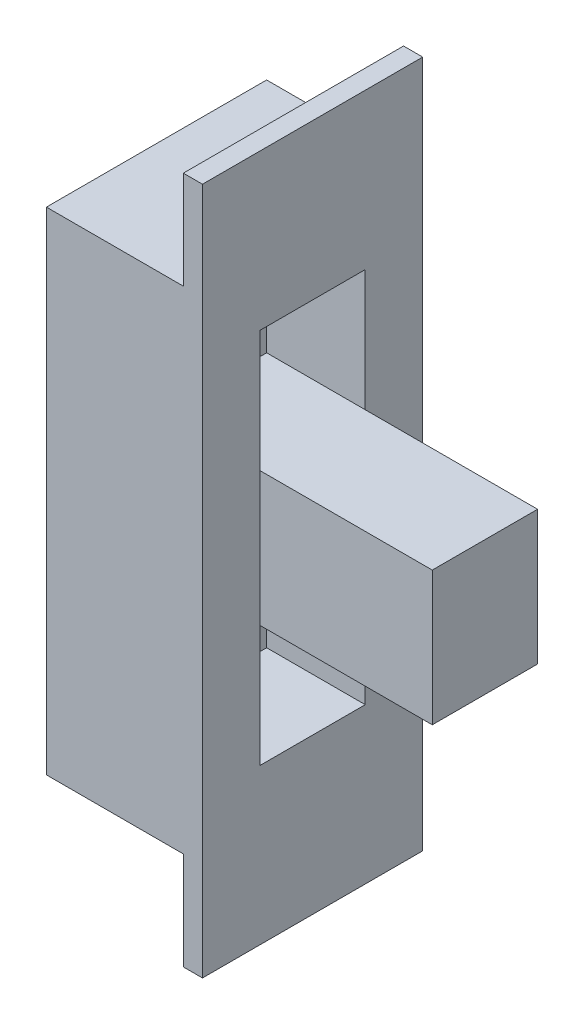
ISO-10303-21;
HEADER;
FILE_DESCRIPTION(('STEP AP214'),'2;1');
FILE_NAME('part.step','',(''),(''),'','','');
FILE_SCHEMA(('AUTOMOTIVE_DESIGN { 1 0 10303 214 1 1 1 1 }'));
ENDSEC;
DATA;
#1=APPLICATION_CONTEXT('core data for automotive mechanical design processes');
#2=APPLICATION_PROTOCOL_DEFINITION('international standard','automotive_design',2000,#1);
#3=PRODUCT_CONTEXT('',#1,'mechanical');
#4=PRODUCT('Part','Part','',(#3));
#5=PRODUCT_RELATED_PRODUCT_CATEGORY('part','',(#4));
#6=PRODUCT_DEFINITION_FORMATION('','',#4);
#7=PRODUCT_DEFINITION_CONTEXT('part definition',#1,'design');
#8=PRODUCT_DEFINITION('design','',#6,#7);
#9=PRODUCT_DEFINITION_SHAPE('','',#8);
#10=(LENGTH_UNIT() NAMED_UNIT(*) SI_UNIT(.MILLI.,.METRE.));
#11=(NAMED_UNIT(*) PLANE_ANGLE_UNIT() SI_UNIT($,.RADIAN.));
#12=(NAMED_UNIT(*) SI_UNIT($,.STERADIAN.) SOLID_ANGLE_UNIT());
#13=UNCERTAINTY_MEASURE_WITH_UNIT(LENGTH_MEASURE(1.E-05),#10,'distance_accuracy_value','');
#14=(GEOMETRIC_REPRESENTATION_CONTEXT(3) GLOBAL_UNCERTAINTY_ASSIGNED_CONTEXT((#13)) GLOBAL_UNIT_ASSIGNED_CONTEXT((#10,
#11,#12)) REPRESENTATION_CONTEXT('',''));
#15=CARTESIAN_POINT('',(0.,0.,0.));
#16=DIRECTION('',(0.,0.,1.));
#17=DIRECTION('',(1.,0.,0.));
#18=AXIS2_PLACEMENT_3D('',#15,#16,#17);
#19=CARTESIAN_POINT('',(-35.8250258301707,28.9408534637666,8.49999999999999));
#20=DIRECTION('',(0.,0.,-1.));
#21=DIRECTION('',(-1.,0.,0.));
#22=AXIS2_PLACEMENT_3D('',#19,#20,#21);
#23=PLANE('',#22);
#24=DIRECTION('',(0.,1.,0.));
#25=VECTOR('',#24,1.);
#26=CARTESIAN_POINT('',(-12.3925708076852,28.9408534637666,8.49999999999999));
#27=LINE('',#26,#25);
#28=CARTESIAN_POINT('',(-12.3925708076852,28.9408534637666,8.49999999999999));
#29=VERTEX_POINT('',#28);
#30=CARTESIAN_POINT('',(-12.3925708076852,35.2793865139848,8.49999999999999));
#31=VERTEX_POINT('',#30);
#32=EDGE_CURVE('E228',#29,#31,#27,.T.);
#33=ORIENTED_EDGE('',*,*,#32,.T.);
#34=DIRECTION('',(-1.,0.,0.));
#35=VECTOR('',#34,1.);
#36=CARTESIAN_POINT('',(10.6596760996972,35.2793865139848,8.50000000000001));
#37=LINE('',#36,#35);
#38=CARTESIAN_POINT('',(-7.24257080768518,35.2793865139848,8.49999999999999));
#39=VERTEX_POINT('',#38);
#40=EDGE_CURVE('E57',#39,#31,#37,.T.);
#41=ORIENTED_EDGE('',*,*,#40,.F.);
#42=DIRECTION('',(0.,1.,0.));
#43=VECTOR('',#42,1.);
#44=CARTESIAN_POINT('',(-7.24257080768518,28.9408534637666,8.49999999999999));
#45=LINE('',#44,#43);
#46=CARTESIAN_POINT('',(-7.24257080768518,28.9408534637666,8.49999999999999));
#47=VERTEX_POINT('',#46);
#48=EDGE_CURVE('E218',#47,#39,#45,.T.);
#49=ORIENTED_EDGE('',*,*,#48,.F.);
#50=DIRECTION('',(1.,0.,0.));
#51=VECTOR('',#50,1.);
#52=CARTESIAN_POINT('',(-35.8250258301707,28.9408534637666,8.49999999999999));
#53=LINE('',#52,#51);
#54=EDGE_CURVE('E223',#29,#47,#53,.T.);
#55=ORIENTED_EDGE('',*,*,#54,.F.);
#56=EDGE_LOOP('',(#33,#41,#49,#55));
#57=FACE_BOUND('',#56,.T.);
#58=ADVANCED_FACE('F32',(#57),#23,.T.);
#59=CARTESIAN_POINT('',(-35.8250258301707,48.6191465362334,3.));
#60=DIRECTION('',(0.,0.,1.));
#61=DIRECTION('',(1.,0.,0.));
#62=AXIS2_PLACEMENT_3D('',#59,#60,#61);
#63=PLANE('',#62);
#64=DIRECTION('',(0.,-1.,0.));
#65=VECTOR('',#64,1.);
#66=CARTESIAN_POINT('',(-7.24257080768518,48.6191465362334,3.));
#67=LINE('',#66,#65);
#68=CARTESIAN_POINT('',(-7.24257080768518,35.2793865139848,3.));
#69=VERTEX_POINT('',#68);
#70=CARTESIAN_POINT('',(-7.24257080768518,28.9408534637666,3.));
#71=VERTEX_POINT('',#70);
#72=EDGE_CURVE('E212',#69,#71,#67,.T.);
#73=ORIENTED_EDGE('',*,*,#72,.F.);
#74=DIRECTION('',(-1.,0.,0.));
#75=VECTOR('',#74,1.);
#76=CARTESIAN_POINT('',(10.6596760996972,35.2793865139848,3.));
#77=LINE('',#76,#75);
#78=CARTESIAN_POINT('',(-12.3925708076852,35.2793865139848,3.));
#79=VERTEX_POINT('',#78);
#80=EDGE_CURVE('E181',#69,#79,#77,.T.);
#81=ORIENTED_EDGE('',*,*,#80,.T.);
#82=DIRECTION('',(0.,-1.,0.));
#83=VECTOR('',#82,1.);
#84=CARTESIAN_POINT('',(-12.3925708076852,48.6191465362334,3.));
#85=LINE('',#84,#83);
#86=CARTESIAN_POINT('',(-12.3925708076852,28.9408534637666,3.));
#87=VERTEX_POINT('',#86);
#88=EDGE_CURVE('E211',#79,#87,#85,.T.);
#89=ORIENTED_EDGE('',*,*,#88,.T.);
#90=DIRECTION('',(1.,0.,0.));
#91=VECTOR('',#90,1.);
#92=CARTESIAN_POINT('',(-35.8250258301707,28.9408534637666,3.));
#93=LINE('',#92,#91);
#94=EDGE_CURVE('E207',#87,#71,#93,.T.);
#95=ORIENTED_EDGE('',*,*,#94,.T.);
#96=EDGE_LOOP('',(#73,#81,#89,#95));
#97=FACE_BOUND('',#96,.T.);
#98=ADVANCED_FACE('F359',(#97),#63,.T.);
#99=CARTESIAN_POINT('',(-12.3925708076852,25.9408534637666,0.));
#100=DIRECTION('',(-1.,0.,0.));
#101=DIRECTION('',(0.,0.,1.));
#102=AXIS2_PLACEMENT_3D('',#99,#100,#101);
#103=PLANE('',#102);
#104=DIRECTION('',(0.,0.,-1.));
#105=VECTOR('',#104,1.);
#106=CARTESIAN_POINT('',(-12.3925708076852,35.2793865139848,8.50000000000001));
#107=LINE('',#106,#105);
#108=EDGE_CURVE('E193',#31,#79,#107,.T.);
#109=ORIENTED_EDGE('',*,*,#108,.F.);
#110=ORIENTED_EDGE('',*,*,#32,.F.);
#111=DIRECTION('',(0.,0.,1.));
#112=VECTOR('',#111,1.);
#113=CARTESIAN_POINT('',(-12.3925708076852,28.9408534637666,3.));
#114=LINE('',#113,#112);
#115=EDGE_CURVE('E231',#87,#29,#114,.T.);
#116=ORIENTED_EDGE('',*,*,#115,.F.);
#117=ORIENTED_EDGE('',*,*,#88,.F.);
#118=EDGE_LOOP('',(#109,#110,#116,#117));
#119=FACE_BOUND('',#118,.T.);
#120=ADVANCED_FACE('F365',(#119),#103,.F.);
#121=CARTESIAN_POINT('',(-7.24257080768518,56.73,11.5));
#122=DIRECTION('',(1.,0.,0.));
#123=DIRECTION('',(0.,0.,-1.));
#124=AXIS2_PLACEMENT_3D('',#121,#122,#123);
#125=PLANE('',#124);
#126=DIRECTION('',(0.,-1.,0.));
#127=VECTOR('',#126,1.);
#128=CARTESIAN_POINT('',(-7.24257080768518,56.73,11.5));
#129=LINE('',#128,#127);
#130=CARTESIAN_POINT('',(-7.24257080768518,56.73,11.5));
#131=VERTEX_POINT('',#130);
#132=CARTESIAN_POINT('',(-7.24257080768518,20.83,11.5));
#133=VERTEX_POINT('',#132);
#134=EDGE_CURVE('E309',#131,#133,#129,.T.);
#135=ORIENTED_EDGE('',*,*,#134,.T.);
#136=DIRECTION('',(0.,0.,-1.));
#137=VECTOR('',#136,1.);
#138=CARTESIAN_POINT('',(-7.24257080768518,20.83,11.5));
#139=LINE('',#138,#137);
#140=CARTESIAN_POINT('',(-7.24257080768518,20.83,0.));
#141=VERTEX_POINT('',#140);
#142=EDGE_CURVE('E306',#133,#141,#139,.T.);
#143=ORIENTED_EDGE('',*,*,#142,.T.);
#144=DIRECTION('',(0.,-1.,0.));
#145=VECTOR('',#144,1.);
#146=CARTESIAN_POINT('',(-7.24257080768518,56.73,0.));
#147=LINE('',#146,#145);
#148=CARTESIAN_POINT('',(-7.24257080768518,56.73,0.));
#149=VERTEX_POINT('',#148);
#150=EDGE_CURVE('E290',#149,#141,#147,.T.);
#151=ORIENTED_EDGE('',*,*,#150,.F.);
#152=DIRECTION('',(0.,0.,-1.));
#153=VECTOR('',#152,1.);
#154=CARTESIAN_POINT('',(-7.24257080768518,56.73,11.5));
#155=LINE('',#154,#153);
#156=EDGE_CURVE('E308',#131,#149,#155,.T.);
#157=ORIENTED_EDGE('',*,*,#156,.F.);
#158=EDGE_LOOP('',(#135,#143,#151,#157));
#159=FACE_BOUND('',#158,.T.);
#160=CARTESIAN_POINT('',(-7.24257080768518,48.6191465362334,3.));
#161=VERTEX_POINT('',#160);
#162=CARTESIAN_POINT('',(-7.24257080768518,42.2793865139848,3.));
#163=VERTEX_POINT('',#162);
#164=EDGE_CURVE('E208',#161,#163,#67,.T.);
#165=ORIENTED_EDGE('',*,*,#164,.T.);
#166=DIRECTION('',(0.,-1.,0.));
#167=VECTOR('',#166,1.);
#168=CARTESIAN_POINT('',(-7.24257080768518,56.73,3.));
#169=LINE('',#168,#167);
#170=EDGE_CURVE('E178',#163,#69,#169,.T.);
#171=ORIENTED_EDGE('',*,*,#170,.T.);
#172=ORIENTED_EDGE('',*,*,#72,.T.);
#173=DIRECTION('',(0.,0.,1.));
#174=VECTOR('',#173,1.);
#175=CARTESIAN_POINT('',(-7.24257080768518,28.9408534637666,3.));
#176=LINE('',#175,#174);
#177=EDGE_CURVE('E220',#71,#47,#176,.T.);
#178=ORIENTED_EDGE('',*,*,#177,.T.);
#179=ORIENTED_EDGE('',*,*,#48,.T.);
#180=DIRECTION('',(0.,1.,0.));
#181=VECTOR('',#180,1.);
#182=CARTESIAN_POINT('',(-7.24257080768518,56.73,8.50000000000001));
#183=LINE('',#182,#181);
#184=CARTESIAN_POINT('',(-7.24257080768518,42.2793865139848,8.49999999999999));
#185=VERTEX_POINT('',#184);
#186=EDGE_CURVE('E203',#39,#185,#183,.T.);
#187=ORIENTED_EDGE('',*,*,#186,.T.);
#188=CARTESIAN_POINT('',(-7.24257080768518,48.6191465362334,8.49999999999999));
#189=VERTEX_POINT('',#188);
#190=EDGE_CURVE('E49',#185,#189,#45,.T.);
#191=ORIENTED_EDGE('',*,*,#190,.T.);
#192=DIRECTION('',(0.,0.,-1.));
#193=VECTOR('',#192,1.);
#194=CARTESIAN_POINT('',(-7.24257080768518,48.6191465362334,8.49999999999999));
#195=LINE('',#194,#193);
#196=EDGE_CURVE('E213',#189,#161,#195,.T.);
#197=ORIENTED_EDGE('',*,*,#196,.T.);
#198=EDGE_LOOP('',(#165,#171,#172,#178,#179,#187,#191,#197));
#199=FACE_BOUND('',#198,.T.);
#200=ADVANCED_FACE('F321',(#159,#199),#125,.T.);
#201=CARTESIAN_POINT('',(-8.24257080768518,20.83,11.5));
#202=DIRECTION('',(-1.,0.,0.));
#203=DIRECTION('',(0.,0.,1.));
#204=AXIS2_PLACEMENT_3D('',#201,#202,#203);
#205=PLANE('',#204);
#206=DIRECTION('',(0.,1.,0.));
#207=VECTOR('',#206,1.);
#208=CARTESIAN_POINT('',(-8.24257080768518,20.83,0.));
#209=LINE('',#208,#207);
#210=CARTESIAN_POINT('',(-8.24257080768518,51.6191465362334,0.));
#211=VERTEX_POINT('',#210);
#212=CARTESIAN_POINT('',(-8.24257080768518,56.73,0.));
#213=VERTEX_POINT('',#212);
#214=EDGE_CURVE('E277',#211,#213,#209,.T.);
#215=ORIENTED_EDGE('',*,*,#214,.F.);
#216=DIRECTION('',(0.,0.,1.));
#217=VECTOR('',#216,1.);
#218=CARTESIAN_POINT('',(-8.24257080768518,51.6191465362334,0.));
#219=LINE('',#218,#217);
#220=CARTESIAN_POINT('',(-8.24257080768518,51.6191465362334,11.5));
#221=VERTEX_POINT('',#220);
#222=EDGE_CURVE('E250',#211,#221,#219,.T.);
#223=ORIENTED_EDGE('',*,*,#222,.T.);
#224=DIRECTION('',(0.,1.,0.));
#225=VECTOR('',#224,1.);
#226=CARTESIAN_POINT('',(-8.24257080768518,20.83,11.5));
#227=LINE('',#226,#225);
#228=CARTESIAN_POINT('',(-8.24257080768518,56.73,11.5));
#229=VERTEX_POINT('',#228);
#230=EDGE_CURVE('E296',#221,#229,#227,.T.);
#231=ORIENTED_EDGE('',*,*,#230,.T.);
#232=DIRECTION('',(0.,0.,-1.));
#233=VECTOR('',#232,1.);
#234=CARTESIAN_POINT('',(-8.24257080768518,56.73,11.5));
#235=LINE('',#234,#233);
#236=EDGE_CURVE('E11',#229,#213,#235,.T.);
#237=ORIENTED_EDGE('',*,*,#236,.T.);
#238=EDGE_LOOP('',(#215,#223,#231,#237));
#239=FACE_BOUND('',#238,.T.);
#240=ADVANCED_FACE('F335',(#239),#205,.T.);
#241=CARTESIAN_POINT('',(-7.24257080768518,56.73,11.5));
#242=DIRECTION('',(0.,-1.,0.));
#243=DIRECTION('',(0.,0.,-1.));
#244=AXIS2_PLACEMENT_3D('',#241,#242,#243);
#245=PLANE('',#244);
#246=ORIENTED_EDGE('',*,*,#236,.F.);
#247=DIRECTION('',(-1.,0.,0.));
#248=VECTOR('',#247,1.);
#249=CARTESIAN_POINT('',(-7.24257080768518,56.73,11.5));
#250=LINE('',#249,#248);
#251=EDGE_CURVE('E293',#131,#229,#250,.T.);
#252=ORIENTED_EDGE('',*,*,#251,.F.);
#253=ORIENTED_EDGE('',*,*,#156,.T.);
#254=DIRECTION('',(-1.,0.,0.));
#255=VECTOR('',#254,1.);
#256=CARTESIAN_POINT('',(-7.24257080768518,56.73,0.));
#257=LINE('',#256,#255);
#258=EDGE_CURVE('E256',#149,#213,#257,.T.);
#259=ORIENTED_EDGE('',*,*,#258,.T.);
#260=EDGE_LOOP('',(#246,#252,#253,#259));
#261=FACE_BOUND('',#260,.T.);
#262=ADVANCED_FACE('F331',(#261),#245,.F.);
#263=DIRECTION('',(0.,0.,1.));
#264=VECTOR('',#263,1.);
#265=CARTESIAN_POINT('',(-8.24257080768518,25.9408534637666,0.));
#266=LINE('',#265,#264);
#267=CARTESIAN_POINT('',(-8.24257080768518,25.9408534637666,0.));
#268=VERTEX_POINT('',#267);
#269=CARTESIAN_POINT('',(-8.24257080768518,25.9408534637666,11.5));
#270=VERTEX_POINT('',#269);
#271=EDGE_CURVE('E227',#268,#270,#266,.T.);
#272=ORIENTED_EDGE('',*,*,#271,.F.);
#273=CARTESIAN_POINT('',(-8.24257080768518,20.83,0.));
#274=VERTEX_POINT('',#273);
#275=EDGE_CURVE('E280',#274,#268,#209,.T.);
#276=ORIENTED_EDGE('',*,*,#275,.F.);
#277=DIRECTION('',(0.,0.,-1.));
#278=VECTOR('',#277,1.);
#279=CARTESIAN_POINT('',(-8.24257080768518,20.83,11.5));
#280=LINE('',#279,#278);
#281=CARTESIAN_POINT('',(-8.24257080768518,20.83,11.5));
#282=VERTEX_POINT('',#281);
#283=EDGE_CURVE('E41',#282,#274,#280,.T.);
#284=ORIENTED_EDGE('',*,*,#283,.F.);
#285=EDGE_CURVE('E303',#282,#270,#227,.T.);
#286=ORIENTED_EDGE('',*,*,#285,.T.);
#287=EDGE_LOOP('',(#272,#276,#284,#286));
#288=FACE_BOUND('',#287,.T.);
#289=ADVANCED_FACE('F34',(#288),#205,.T.);
#290=CARTESIAN_POINT('',(-8.24257080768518,20.83,11.5));
#291=DIRECTION('',(0.,1.,0.));
#292=DIRECTION('',(0.,0.,1.));
#293=AXIS2_PLACEMENT_3D('',#290,#291,#292);
#294=PLANE('',#293);
#295=ORIENTED_EDGE('',*,*,#142,.F.);
#296=DIRECTION('',(1.,0.,0.));
#297=VECTOR('',#296,1.);
#298=CARTESIAN_POINT('',(-8.24257080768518,20.83,11.5));
#299=LINE('',#298,#297);
#300=EDGE_CURVE('E299',#282,#133,#299,.T.);
#301=ORIENTED_EDGE('',*,*,#300,.F.);
#302=ORIENTED_EDGE('',*,*,#283,.T.);
#303=DIRECTION('',(1.,0.,0.));
#304=VECTOR('',#303,1.);
#305=CARTESIAN_POINT('',(-8.24257080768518,20.83,0.));
#306=LINE('',#305,#304);
#307=EDGE_CURVE('E286',#274,#141,#306,.T.);
#308=ORIENTED_EDGE('',*,*,#307,.T.);
#309=EDGE_LOOP('',(#295,#301,#302,#308));
#310=FACE_BOUND('',#309,.T.);
#311=ADVANCED_FACE('F317',(#310),#294,.F.);
#312=CARTESIAN_POINT('',(-8.24257080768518,56.73,11.5));
#313=DIRECTION('',(0.,0.,-1.));
#314=DIRECTION('',(-1.,0.,0.));
#315=AXIS2_PLACEMENT_3D('',#312,#313,#314);
#316=PLANE('',#315);
#317=ORIENTED_EDGE('',*,*,#251,.T.);
#318=ORIENTED_EDGE('',*,*,#230,.F.);
#319=DIRECTION('',(1.,0.,0.));
#320=VECTOR('',#319,1.);
#321=CARTESIAN_POINT('',(-15.3925708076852,51.6191465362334,11.5));
#322=LINE('',#321,#320);
#323=CARTESIAN_POINT('',(-15.3925708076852,51.6191465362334,11.5));
#324=VERTEX_POINT('',#323);
#325=EDGE_CURVE('E263',#324,#221,#322,.T.);
#326=ORIENTED_EDGE('',*,*,#325,.F.);
#327=DIRECTION('',(0.,1.,0.));
#328=VECTOR('',#327,1.);
#329=CARTESIAN_POINT('',(-15.3925708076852,25.9408534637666,11.5));
#330=LINE('',#329,#328);
#331=CARTESIAN_POINT('',(-15.3925708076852,25.9408534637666,11.5));
#332=VERTEX_POINT('',#331);
#333=EDGE_CURVE('E345',#332,#324,#330,.T.);
#334=ORIENTED_EDGE('',*,*,#333,.F.);
#335=DIRECTION('',(1.,0.,0.));
#336=VECTOR('',#335,1.);
#337=CARTESIAN_POINT('',(-15.3925708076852,25.9408534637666,11.5));
#338=LINE('',#337,#336);
#339=EDGE_CURVE('E257',#332,#270,#338,.T.);
#340=ORIENTED_EDGE('',*,*,#339,.T.);
#341=ORIENTED_EDGE('',*,*,#285,.F.);
#342=ORIENTED_EDGE('',*,*,#300,.T.);
#343=ORIENTED_EDGE('',*,*,#134,.F.);
#344=EDGE_LOOP('',(#317,#318,#326,#334,#340,#341,#342,#343));
#345=FACE_BOUND('',#344,.T.);
#346=ADVANCED_FACE('F315',(#345),#316,.F.);
#347=CARTESIAN_POINT('',(-8.24257080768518,56.73,0.));
#348=DIRECTION('',(0.,0.,-1.));
#349=DIRECTION('',(-1.,0.,0.));
#350=AXIS2_PLACEMENT_3D('',#347,#348,#349);
#351=PLANE('',#350);
#352=ORIENTED_EDGE('',*,*,#258,.F.);
#353=ORIENTED_EDGE('',*,*,#150,.T.);
#354=ORIENTED_EDGE('',*,*,#307,.F.);
#355=ORIENTED_EDGE('',*,*,#275,.T.);
#356=DIRECTION('',(1.,0.,0.));
#357=VECTOR('',#356,1.);
#358=CARTESIAN_POINT('',(-15.3925708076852,25.9408534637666,0.));
#359=LINE('',#358,#357);
#360=CARTESIAN_POINT('',(-15.3925708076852,25.9408534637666,0.));
#361=VERTEX_POINT('',#360);
#362=EDGE_CURVE('E253',#361,#268,#359,.T.);
#363=ORIENTED_EDGE('',*,*,#362,.F.);
#364=DIRECTION('',(0.,-1.,0.));
#365=VECTOR('',#364,1.);
#366=CARTESIAN_POINT('',(-15.3925708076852,51.6191465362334,0.));
#367=LINE('',#366,#365);
#368=CARTESIAN_POINT('',(-15.3925708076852,51.6191465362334,0.));
#369=VERTEX_POINT('',#368);
#370=EDGE_CURVE('E267',#369,#361,#367,.T.);
#371=ORIENTED_EDGE('',*,*,#370,.F.);
#372=DIRECTION('',(1.,0.,0.));
#373=VECTOR('',#372,1.);
#374=CARTESIAN_POINT('',(-15.3925708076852,51.6191465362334,0.));
#375=LINE('',#374,#373);
#376=EDGE_CURVE('E260',#369,#211,#375,.T.);
#377=ORIENTED_EDGE('',*,*,#376,.T.);
#378=ORIENTED_EDGE('',*,*,#214,.T.);
#379=EDGE_LOOP('',(#352,#353,#354,#355,#363,#371,#377,#378));
#380=FACE_BOUND('',#379,.T.);
#381=ADVANCED_FACE('F326',(#380),#351,.T.);
#382=CARTESIAN_POINT('',(-15.3925708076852,25.9408534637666,0.));
#383=DIRECTION('',(0.,1.,0.));
#384=DIRECTION('',(0.,0.,1.));
#385=AXIS2_PLACEMENT_3D('',#382,#383,#384);
#386=PLANE('',#385);
#387=ORIENTED_EDGE('',*,*,#339,.F.);
#388=DIRECTION('',(0.,0.,1.));
#389=VECTOR('',#388,1.);
#390=CARTESIAN_POINT('',(-15.3925708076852,25.9408534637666,0.));
#391=LINE('',#390,#389);
#392=EDGE_CURVE('E343',#361,#332,#391,.T.);
#393=ORIENTED_EDGE('',*,*,#392,.F.);
#394=ORIENTED_EDGE('',*,*,#362,.T.);
#395=ORIENTED_EDGE('',*,*,#271,.T.);
#396=EDGE_LOOP('',(#387,#393,#394,#395));
#397=FACE_BOUND('',#396,.T.);
#398=ADVANCED_FACE('F349',(#397),#386,.F.);
#399=CARTESIAN_POINT('',(-15.3925708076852,51.6191465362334,0.));
#400=DIRECTION('',(0.,1.,0.));
#401=DIRECTION('',(0.,0.,1.));
#402=AXIS2_PLACEMENT_3D('',#399,#400,#401);
#403=PLANE('',#402);
#404=DIRECTION('',(0.,0.,1.));
#405=VECTOR('',#404,1.);
#406=CARTESIAN_POINT('',(-15.3925708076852,51.6191465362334,0.));
#407=LINE('',#406,#405);
#408=EDGE_CURVE('E264',#369,#324,#407,.T.);
#409=ORIENTED_EDGE('',*,*,#408,.T.);
#410=ORIENTED_EDGE('',*,*,#325,.T.);
#411=ORIENTED_EDGE('',*,*,#222,.F.);
#412=ORIENTED_EDGE('',*,*,#376,.F.);
#413=EDGE_LOOP('',(#409,#410,#411,#412));
#414=FACE_BOUND('',#413,.T.);
#415=ADVANCED_FACE('F336',(#414),#403,.T.);
#416=CARTESIAN_POINT('',(-15.3925708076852,25.9408534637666,0.));
#417=DIRECTION('',(-1.,0.,0.));
#418=DIRECTION('',(0.,0.,1.));
#419=AXIS2_PLACEMENT_3D('',#416,#417,#418);
#420=PLANE('',#419);
#421=ORIENTED_EDGE('',*,*,#370,.T.);
#422=ORIENTED_EDGE('',*,*,#392,.T.);
#423=ORIENTED_EDGE('',*,*,#333,.T.);
#424=ORIENTED_EDGE('',*,*,#408,.F.);
#425=EDGE_LOOP('',(#421,#422,#423,#424));
#426=FACE_BOUND('',#425,.T.);
#427=ADVANCED_FACE('F344',(#426),#420,.T.);
#428=CARTESIAN_POINT('',(-35.8250258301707,28.9408534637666,3.));
#429=DIRECTION('',(0.,1.,0.));
#430=DIRECTION('',(0.,0.,1.));
#431=AXIS2_PLACEMENT_3D('',#428,#429,#430);
#432=PLANE('',#431);
#433=ORIENTED_EDGE('',*,*,#115,.T.);
#434=ORIENTED_EDGE('',*,*,#54,.T.);
#435=ORIENTED_EDGE('',*,*,#177,.F.);
#436=ORIENTED_EDGE('',*,*,#94,.F.);
#437=EDGE_LOOP('',(#433,#434,#435,#436));
#438=FACE_BOUND('',#437,.T.);
#439=ADVANCED_FACE('F373',(#438),#432,.T.);
#440=DIRECTION('',(-1.,0.,0.));
#441=VECTOR('',#440,1.);
#442=CARTESIAN_POINT('',(10.6596760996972,42.2793865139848,8.50000000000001));
#443=LINE('',#442,#441);
#444=CARTESIAN_POINT('',(-12.3925708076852,42.2793865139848,8.49999999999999));
#445=VERTEX_POINT('',#444);
#446=EDGE_CURVE('E204',#185,#445,#443,.T.);
#447=ORIENTED_EDGE('',*,*,#446,.T.);
#448=CARTESIAN_POINT('',(-12.3925708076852,48.6191465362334,8.49999999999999));
#449=VERTEX_POINT('',#448);
#450=EDGE_CURVE('E230',#445,#449,#27,.T.);
#451=ORIENTED_EDGE('',*,*,#450,.T.);
#452=DIRECTION('',(1.,0.,0.));
#453=VECTOR('',#452,1.);
#454=CARTESIAN_POINT('',(-35.8250258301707,48.6191465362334,8.49999999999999));
#455=LINE('',#454,#453);
#456=EDGE_CURVE('E217',#449,#189,#455,.T.);
#457=ORIENTED_EDGE('',*,*,#456,.T.);
#458=ORIENTED_EDGE('',*,*,#190,.F.);
#459=EDGE_LOOP('',(#447,#451,#457,#458));
#460=FACE_BOUND('',#459,.T.);
#461=ADVANCED_FACE('F361',(#460),#23,.T.);
#462=CARTESIAN_POINT('',(-35.8250258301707,48.6191465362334,8.49999999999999));
#463=DIRECTION('',(0.,-1.,0.));
#464=DIRECTION('',(0.,0.,-1.));
#465=AXIS2_PLACEMENT_3D('',#462,#463,#464);
#466=PLANE('',#465);
#467=DIRECTION('',(0.,0.,-1.));
#468=VECTOR('',#467,1.);
#469=CARTESIAN_POINT('',(-12.3925708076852,48.6191465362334,8.49999999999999));
#470=LINE('',#469,#468);
#471=CARTESIAN_POINT('',(-12.3925708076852,48.6191465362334,3.));
#472=VERTEX_POINT('',#471);
#473=EDGE_CURVE('E224',#449,#472,#470,.T.);
#474=ORIENTED_EDGE('',*,*,#473,.T.);
#475=DIRECTION('',(1.,0.,0.));
#476=VECTOR('',#475,1.);
#477=CARTESIAN_POINT('',(-35.8250258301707,48.6191465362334,3.));
#478=LINE('',#477,#476);
#479=EDGE_CURVE('E216',#472,#161,#478,.T.);
#480=ORIENTED_EDGE('',*,*,#479,.T.);
#481=ORIENTED_EDGE('',*,*,#196,.F.);
#482=ORIENTED_EDGE('',*,*,#456,.F.);
#483=EDGE_LOOP('',(#474,#480,#481,#482));
#484=FACE_BOUND('',#483,.T.);
#485=ADVANCED_FACE('F372',(#484),#466,.T.);
#486=DIRECTION('',(-1.,0.,0.));
#487=VECTOR('',#486,1.);
#488=CARTESIAN_POINT('',(10.6596760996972,42.2793865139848,3.));
#489=LINE('',#488,#487);
#490=CARTESIAN_POINT('',(-12.3925708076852,42.2793865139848,3.));
#491=VERTEX_POINT('',#490);
#492=EDGE_CURVE('E182',#163,#491,#489,.T.);
#493=ORIENTED_EDGE('',*,*,#492,.F.);
#494=ORIENTED_EDGE('',*,*,#164,.F.);
#495=ORIENTED_EDGE('',*,*,#479,.F.);
#496=EDGE_CURVE('E234',#472,#491,#85,.T.);
#497=ORIENTED_EDGE('',*,*,#496,.T.);
#498=EDGE_LOOP('',(#493,#494,#495,#497));
#499=FACE_BOUND('',#498,.T.);
#500=ADVANCED_FACE('F368',(#499),#63,.T.);
#501=ORIENTED_EDGE('',*,*,#450,.F.);
#502=DIRECTION('',(0.,0.,-1.));
#503=VECTOR('',#502,1.);
#504=CARTESIAN_POINT('',(-12.3925708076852,42.2793865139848,8.50000000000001));
#505=LINE('',#504,#503);
#506=EDGE_CURVE('E171',#445,#491,#505,.T.);
#507=ORIENTED_EDGE('',*,*,#506,.T.);
#508=ORIENTED_EDGE('',*,*,#496,.F.);
#509=ORIENTED_EDGE('',*,*,#473,.F.);
#510=EDGE_LOOP('',(#501,#507,#508,#509));
#511=FACE_BOUND('',#510,.T.);
#512=ADVANCED_FACE('F384',(#511),#103,.F.);
#513=CARTESIAN_POINT('',(1.75742919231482,56.73,11.5));
#514=DIRECTION('',(1.,0.,0.));
#515=DIRECTION('',(0.,0.,-1.));
#516=AXIS2_PLACEMENT_3D('',#513,#514,#515);
#517=PLANE('',#516);
#518=DIRECTION('',(0.,0.,-1.));
#519=VECTOR('',#518,1.);
#520=CARTESIAN_POINT('',(1.75742919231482,42.2793865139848,8.50000000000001));
#521=LINE('',#520,#519);
#522=CARTESIAN_POINT('',(1.75742919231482,42.2793865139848,8.50000000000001));
#523=VERTEX_POINT('',#522);
#524=CARTESIAN_POINT('',(1.75742919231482,42.2793865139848,3.));
#525=VERTEX_POINT('',#524);
#526=EDGE_CURVE('E164',#523,#525,#521,.T.);
#527=ORIENTED_EDGE('',*,*,#526,.F.);
#528=DIRECTION('',(0.,-1.,0.));
#529=VECTOR('',#528,1.);
#530=CARTESIAN_POINT('',(1.75742919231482,42.2793865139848,8.50000000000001));
#531=LINE('',#530,#529);
#532=CARTESIAN_POINT('',(1.75742919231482,35.2793865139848,8.50000000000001));
#533=VERTEX_POINT('',#532);
#534=EDGE_CURVE('E194',#523,#533,#531,.T.);
#535=ORIENTED_EDGE('',*,*,#534,.T.);
#536=DIRECTION('',(0.,0.,-1.));
#537=VECTOR('',#536,1.);
#538=CARTESIAN_POINT('',(1.75742919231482,35.2793865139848,8.50000000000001));
#539=LINE('',#538,#537);
#540=CARTESIAN_POINT('',(1.75742919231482,35.2793865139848,3.));
#541=VERTEX_POINT('',#540);
#542=EDGE_CURVE('E167',#533,#541,#539,.T.);
#543=ORIENTED_EDGE('',*,*,#542,.T.);
#544=DIRECTION('',(0.,1.,0.));
#545=VECTOR('',#544,1.);
#546=CARTESIAN_POINT('',(1.75742919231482,35.2793865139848,3.));
#547=LINE('',#546,#545);
#548=EDGE_CURVE('E160',#541,#525,#547,.T.);
#549=ORIENTED_EDGE('',*,*,#548,.T.);
#550=EDGE_LOOP('',(#527,#535,#543,#549));
#551=FACE_BOUND('',#550,.T.);
#552=ADVANCED_FACE('F162',(#551),#517,.T.);
#553=CARTESIAN_POINT('',(10.6596760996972,42.2793865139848,8.50000000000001));
#554=DIRECTION('',(0.,1.,0.));
#555=DIRECTION('',(0.,0.,1.));
#556=AXIS2_PLACEMENT_3D('',#553,#554,#555);
#557=PLANE('',#556);
#558=EDGE_CURVE('E188',#523,#185,#443,.T.);
#559=ORIENTED_EDGE('',*,*,#558,.F.);
#560=ORIENTED_EDGE('',*,*,#526,.T.);
#561=EDGE_CURVE('E175',#525,#163,#489,.T.);
#562=ORIENTED_EDGE('',*,*,#561,.T.);
#563=ORIENTED_EDGE('',*,*,#492,.T.);
#564=ORIENTED_EDGE('',*,*,#506,.F.);
#565=ORIENTED_EDGE('',*,*,#446,.F.);
#566=EDGE_LOOP('',(#559,#560,#562,#563,#564,#565));
#567=FACE_BOUND('',#566,.T.);
#568=ADVANCED_FACE('F185',(#567),#557,.T.);
#569=CARTESIAN_POINT('',(10.6596760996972,35.2793865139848,3.));
#570=DIRECTION('',(0.,0.,1.));
#571=DIRECTION('',(1.,0.,0.));
#572=AXIS2_PLACEMENT_3D('',#569,#570,#571);
#573=PLANE('',#572);
#574=ORIENTED_EDGE('',*,*,#170,.F.);
#575=ORIENTED_EDGE('',*,*,#561,.F.);
#576=ORIENTED_EDGE('',*,*,#548,.F.);
#577=EDGE_CURVE('E200',#541,#69,#77,.T.);
#578=ORIENTED_EDGE('',*,*,#577,.T.);
#579=EDGE_LOOP('',(#574,#575,#576,#578));
#580=FACE_BOUND('',#579,.T.);
#581=ADVANCED_FACE('F176',(#580),#573,.F.);
#582=CARTESIAN_POINT('',(10.6596760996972,35.2793865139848,8.50000000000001));
#583=DIRECTION('',(0.,1.,0.));
#584=DIRECTION('',(0.,0.,1.));
#585=AXIS2_PLACEMENT_3D('',#582,#583,#584);
#586=PLANE('',#585);
#587=ORIENTED_EDGE('',*,*,#542,.F.);
#588=EDGE_CURVE('E197',#533,#39,#37,.T.);
#589=ORIENTED_EDGE('',*,*,#588,.T.);
#590=ORIENTED_EDGE('',*,*,#40,.T.);
#591=ORIENTED_EDGE('',*,*,#108,.T.);
#592=ORIENTED_EDGE('',*,*,#80,.F.);
#593=ORIENTED_EDGE('',*,*,#577,.F.);
#594=EDGE_LOOP('',(#587,#589,#590,#591,#592,#593));
#595=FACE_BOUND('',#594,.T.);
#596=ADVANCED_FACE('F396',(#595),#586,.F.);
#597=CARTESIAN_POINT('',(10.6596760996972,42.2793865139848,8.50000000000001));
#598=DIRECTION('',(0.,0.,-1.));
#599=DIRECTION('',(-1.,0.,0.));
#600=AXIS2_PLACEMENT_3D('',#597,#598,#599);
#601=PLANE('',#600);
#602=ORIENTED_EDGE('',*,*,#186,.F.);
#603=ORIENTED_EDGE('',*,*,#588,.F.);
#604=ORIENTED_EDGE('',*,*,#534,.F.);
#605=ORIENTED_EDGE('',*,*,#558,.T.);
#606=EDGE_LOOP('',(#602,#603,#604,#605));
#607=FACE_BOUND('',#606,.T.);
#608=ADVANCED_FACE('F394',(#607),#601,.F.);
#609=CLOSED_SHELL('',(#58,#98,#120,#200,#240,#262,#289,#311,#346,#381,#398,#415,#427,#439,#461,
#485,#500,#512,#552,#568,#581,#596,#608));
#610=MANIFOLD_SOLID_BREP('B2',#609);
#611=ADVANCED_BREP_SHAPE_REPRESENTATION('',(#18,#610),#14);
#612=SHAPE_DEFINITION_REPRESENTATION(#9,#611);
ENDSEC;
END-ISO-10303-21;
